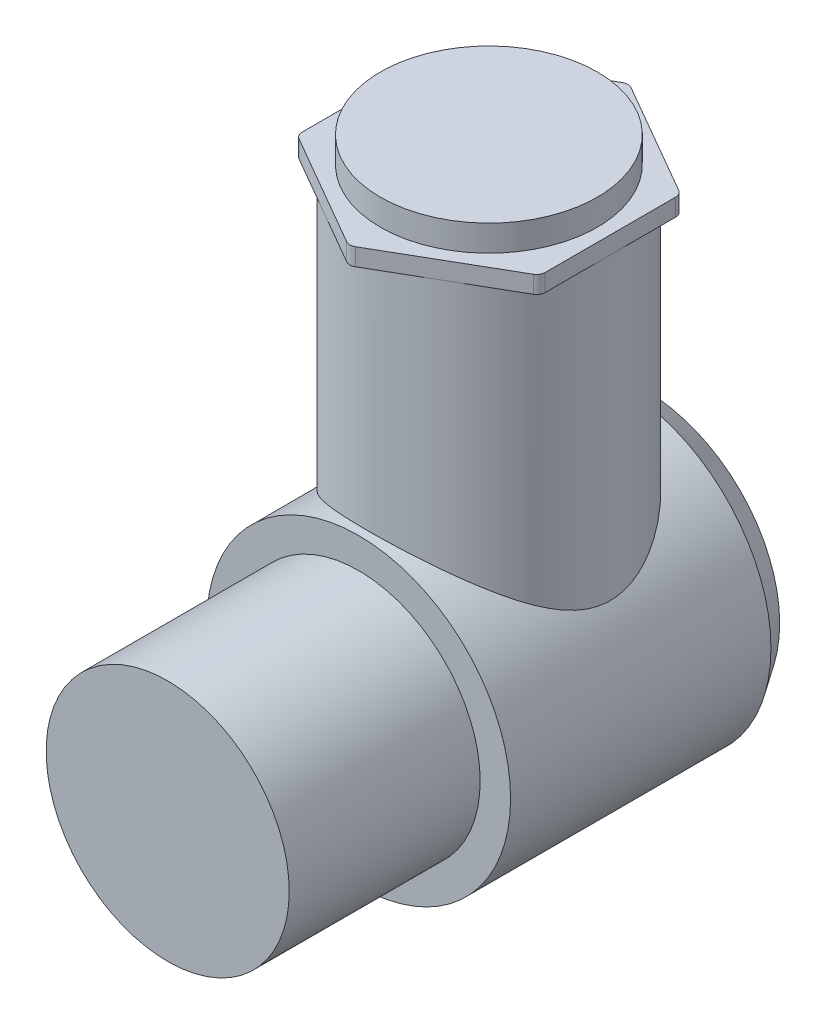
from build123d import *

# Parameters (mm, degrees)
SKETCH1_R           = 175
BOSS_EXTRUDE1_DEPTH = 150
SKETCH2_R           = 140
BOSS_EXTRUDE2_DEPTH = 220
SKETCH3_R           = 140
BOSS_EXTRUDE3_DEPTH = 450
BOSS_EXTRUDE4_DEPTH = 20
SKETCH5_R           = 125
BOSS_EXTRUDE5_DEPTH = 30
SKETCH6_R           = 155
BOSS_EXTRUDE6_DEPTH = 30
FILLET1_R           = 10


with BuildPart() as part:
    # Sketch1 → Boss-Extrude1 (new, symmetric)
    with BuildSketch(Plane.XY):
        Circle(SKETCH1_R)
    extrude(amount=BOSS_EXTRUDE1_DEPTH, both=True)

    # Sketch2 → Boss-Extrude2 (add)
    with BuildSketch(Plane.XY.offset(150)):
        Circle(SKETCH2_R)
    extrude(amount=BOSS_EXTRUDE2_DEPTH)

    # Sketch3 → Boss-Extrude3 (add)
    with BuildSketch(Plane(origin=(0, 0, 0), x_dir=(1, 0, 0), z_dir=(0, 1, 0))):
        with Locations(Location((0, 0, 0), (0, 0, 90))):
            Circle(SKETCH3_R)
    extrude(amount=BOSS_EXTRUDE3_DEPTH)

    # Sketch4 → Boss-Extrude4 (add)
    with BuildSketch(Plane(origin=(0, 450, 0), x_dir=(1, 0, 0), z_dir=(0, 1, 0))):
        Polygon((140, -80.829037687), (140, 80.829037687), (0, 161.658075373), (-140, 80.829037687), (-140, -80.829037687), (0, -161.658075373), align=None)
    extrude(amount=BOSS_EXTRUDE4_DEPTH)

    # Sketch5 → Boss-Extrude5 (add)
    with BuildSketch(Plane(origin=(0, 470, 0), x_dir=(1, 0, 0), z_dir=(0, 1, 0))):
        with Locations(Location((0, 0, 0), (0, 0, 270))):
            Circle(SKETCH5_R)
    extrude(amount=BOSS_EXTRUDE5_DEPTH)

    # Sketch6 → Boss-Extrude6 (add)
    with BuildSketch(Plane(origin=(0, 0, -150), x_dir=(-1, 0, 0), z_dir=(0, 0, -1))):
        Circle(SKETCH6_R)
    extrude(amount=BOSS_EXTRUDE6_DEPTH)

    # loft up to a face of the part (loft1)
    loft([Face(Wire([part.edges().sort_by_distance((106.104801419, 112.99013725, -180))[0]])), Face(Wire([part.edges().sort_by_distance((-119.795743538, -127.569509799, -150))[0]]))])

    # Fillet1
    fillet1_edges = [part.edges().sort_by_distance(p)[0] for p in [
        (0, 460, 161.658075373),
        (140, 460, 80.829037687),
        (140, 460, -80.829037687),
        (0, 460, -161.658075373),
        (-140, 460, -80.829037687),
        (-140, 460, 80.829037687),
    ]]
    fillet(fillet1_edges, radius=FILLET1_R)


solid = part.part
